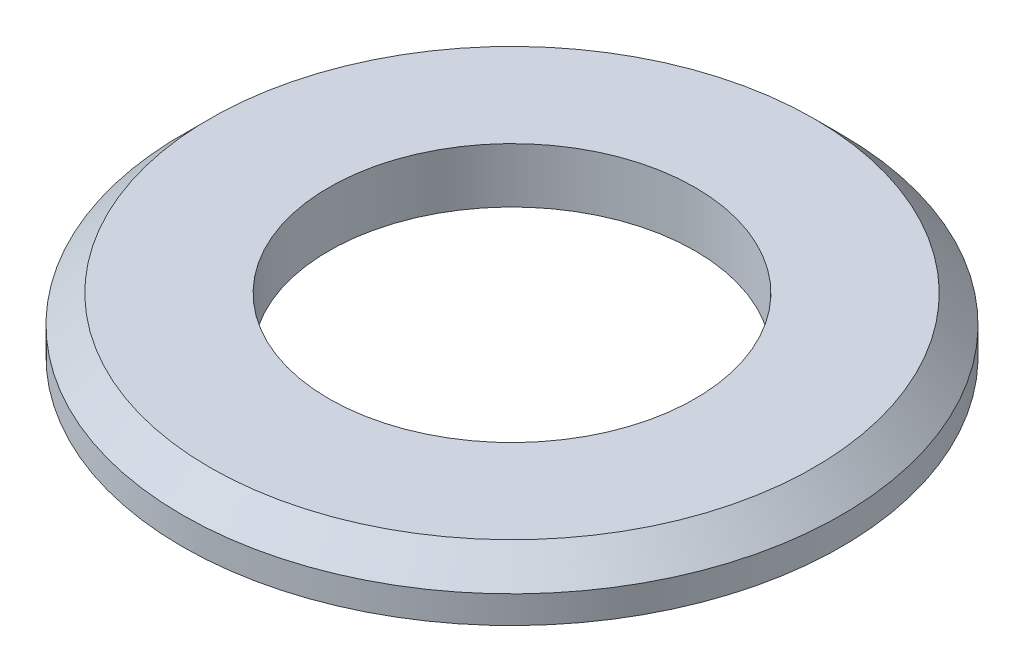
from build123d import *

# Parameters (mm, degrees)
SKETCH1_R      = 36
SKETCH1_R_2    = 20
EXTRUDE1_DEPTH = 6
CHAMFER1_SIZE  = 3


with BuildPart() as part:
    # Sketch1 → Extrude1 (new body)
    with BuildSketch(Plane(origin=(0, 0, 0), x_dir=(1, 0, 0), z_dir=(0, 1, 0))):
        with Locations(Location((0, 0, 0), (0, 0, 270))):
            Circle(SKETCH1_R)
        with Locations(Location((0, 0, 0), (0, 0, 270))):
            Circle(SKETCH1_R_2, mode=Mode.SUBTRACT)
    extrude(amount=EXTRUDE1_DEPTH)

    # Chamfer1
    chamfer1_edges = [part.edges().sort_by_distance(p)[0] for p in [
        (0, 6, -36),
    ]]
    chamfer(chamfer1_edges, length=CHAMFER1_SIZE)


solid = part.part
